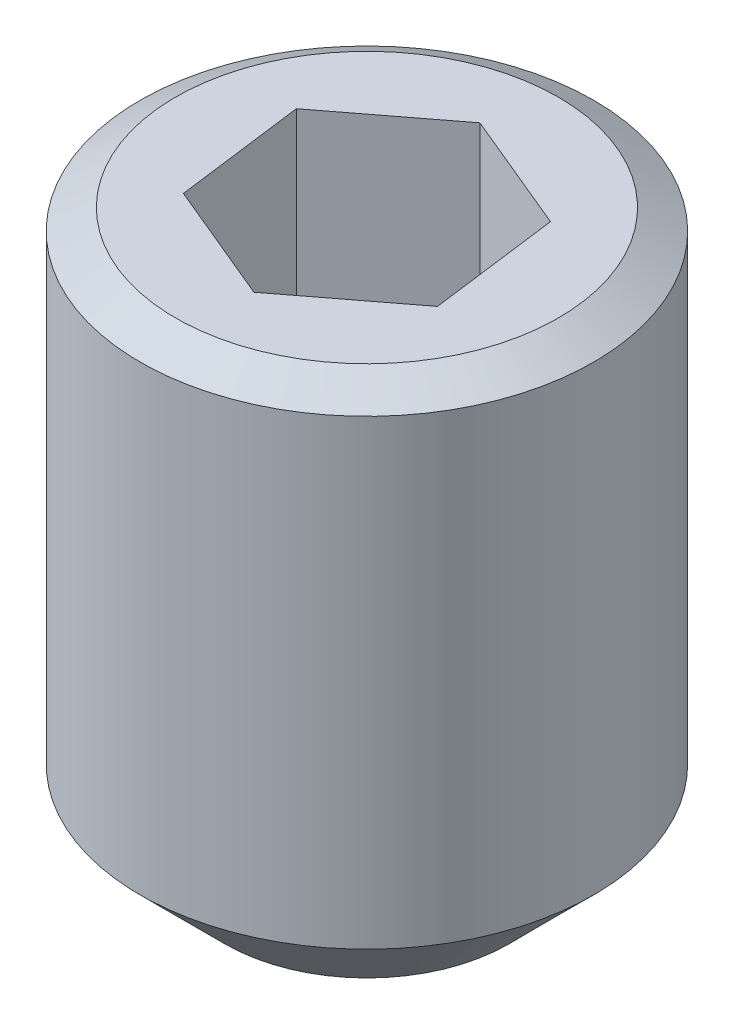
ISO-10303-21;
HEADER;
FILE_DESCRIPTION(('STEP AP214'),'2;1');
FILE_NAME('part.step','',(''),(''),'','','');
FILE_SCHEMA(('AUTOMOTIVE_DESIGN { 1 0 10303 214 1 1 1 1 }'));
ENDSEC;
DATA;
#1=APPLICATION_CONTEXT('core data for automotive mechanical design processes');
#2=APPLICATION_PROTOCOL_DEFINITION('international standard','automotive_design',2000,#1);
#3=PRODUCT_CONTEXT('',#1,'mechanical');
#4=PRODUCT('Part','Part','',(#3));
#5=PRODUCT_RELATED_PRODUCT_CATEGORY('part','',(#4));
#6=PRODUCT_DEFINITION_FORMATION('','',#4);
#7=PRODUCT_DEFINITION_CONTEXT('part definition',#1,'design');
#8=PRODUCT_DEFINITION('design','',#6,#7);
#9=PRODUCT_DEFINITION_SHAPE('','',#8);
#10=(LENGTH_UNIT() NAMED_UNIT(*) SI_UNIT(.MILLI.,.METRE.));
#11=(NAMED_UNIT(*) PLANE_ANGLE_UNIT() SI_UNIT($,.RADIAN.));
#12=(NAMED_UNIT(*) SI_UNIT($,.STERADIAN.) SOLID_ANGLE_UNIT());
#13=UNCERTAINTY_MEASURE_WITH_UNIT(LENGTH_MEASURE(1.E-05),#10,'distance_accuracy_value','');
#14=(GEOMETRIC_REPRESENTATION_CONTEXT(3) GLOBAL_UNCERTAINTY_ASSIGNED_CONTEXT((#13)) GLOBAL_UNIT_ASSIGNED_CONTEXT((#10,
#11,#12)) REPRESENTATION_CONTEXT('',''));
#15=CARTESIAN_POINT('',(0.,0.,0.));
#16=DIRECTION('',(0.,0.,1.));
#17=DIRECTION('',(1.,0.,0.));
#18=AXIS2_PLACEMENT_3D('',#15,#16,#17);
#19=CARTESIAN_POINT('',(3.375,10.,0.));
#20=DIRECTION('',(0.,1.,0.));
#21=DIRECTION('',(0.,0.,1.));
#22=AXIS2_PLACEMENT_3D('',#19,#20,#21);
#23=PLANE('',#22);
#24=DIRECTION('',(0.128888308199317,0.,0.991659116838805));
#25=VECTOR('',#24,1.);
#26=CARTESIAN_POINT('',(-2.13214563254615,10.,-0.887292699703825));
#27=LINE('',#26,#25);
#28=CARTESIAN_POINT('',(-2.13214563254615,10.,-0.887292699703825));
#29=VERTEX_POINT('',#28);
#30=CARTESIAN_POINT('',(-1.83449083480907,10.,1.4028459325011));
#31=VERTEX_POINT('',#30);
#32=EDGE_CURVE('E47',#29,#31,#27,.T.);
#33=ORIENTED_EDGE('',*,*,#32,.F.);
#34=DIRECTION('',(-0.794357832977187,0.,0.607450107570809));
#35=VECTOR('',#34,1.);
#36=CARTESIAN_POINT('',(-0.297654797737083,10.,-2.29013863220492));
#37=LINE('',#36,#35);
#38=CARTESIAN_POINT('',(-0.297654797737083,10.,-2.29013863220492));
#39=VERTEX_POINT('',#38);
#40=EDGE_CURVE('E130',#39,#29,#37,.T.);
#41=ORIENTED_EDGE('',*,*,#40,.F.);
#42=DIRECTION('',(-0.923246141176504,0.,-0.384209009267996));
#43=VECTOR('',#42,1.);
#44=CARTESIAN_POINT('',(1.83449083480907,10.,-1.40284593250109));
#45=LINE('',#44,#43);
#46=CARTESIAN_POINT('',(1.83449083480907,10.,-1.40284593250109));
#47=VERTEX_POINT('',#46);
#48=EDGE_CURVE('E128',#47,#39,#45,.T.);
#49=ORIENTED_EDGE('',*,*,#48,.F.);
#50=DIRECTION('',(-0.128888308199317,0.,-0.991659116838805));
#51=VECTOR('',#50,1.);
#52=CARTESIAN_POINT('',(2.13214563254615,10.,0.88729269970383));
#53=LINE('',#52,#51);
#54=CARTESIAN_POINT('',(2.13214563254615,10.,0.88729269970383));
#55=VERTEX_POINT('',#54);
#56=EDGE_CURVE('E95',#55,#47,#53,.T.);
#57=ORIENTED_EDGE('',*,*,#56,.F.);
#58=DIRECTION('',(0.794357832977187,0.,-0.607450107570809));
#59=VECTOR('',#58,1.);
#60=CARTESIAN_POINT('',(0.297654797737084,10.,2.29013863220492));
#61=LINE('',#60,#59);
#62=CARTESIAN_POINT('',(0.297654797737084,10.,2.29013863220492));
#63=VERTEX_POINT('',#62);
#64=EDGE_CURVE('E124',#63,#55,#61,.T.);
#65=ORIENTED_EDGE('',*,*,#64,.F.);
#66=DIRECTION('',(0.923246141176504,0.,0.384209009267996));
#67=VECTOR('',#66,1.);
#68=CARTESIAN_POINT('',(-1.83449083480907,10.,1.4028459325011));
#69=LINE('',#68,#67);
#70=EDGE_CURVE('E121',#31,#63,#69,.T.);
#71=ORIENTED_EDGE('',*,*,#70,.F.);
#72=EDGE_LOOP('',(#33,#41,#49,#57,#65,#71));
#73=FACE_BOUND('',#72,.T.);
#74=CARTESIAN_POINT('',(0.,10.,0.));
#75=DIRECTION('',(0.,-1.,0.));
#76=DIRECTION('',(0.,0.,-1.));
#77=AXIS2_PLACEMENT_3D('',#74,#75,#76);
#78=CIRCLE('',#77,3.375);
#79=CARTESIAN_POINT('',(0.,10.,-3.375));
#80=VERTEX_POINT('',#79);
#81=EDGE_CURVE('E11',#80,#80,#78,.T.);
#82=ORIENTED_EDGE('',*,*,#81,.F.);
#83=EDGE_LOOP('',(#82));
#84=FACE_BOUND('',#83,.T.);
#85=ADVANCED_FACE('F33',(#73,#84),#23,.T.);
#86=CARTESIAN_POINT('',(0.,9.63915608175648,0.));
#87=DIRECTION('',(0.,-1.,0.));
#88=DIRECTION('',(0.,0.,-1.));
#89=AXIS2_PLACEMENT_3D('',#86,#87,#88);
#90=CONICAL_SURFACE('',#89,4.,1.0471975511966);
#91=ORIENTED_EDGE('',*,*,#81,.T.);
#92=EDGE_LOOP('',(#91));
#93=FACE_BOUND('',#92,.T.);
#94=CARTESIAN_POINT('',(0.,9.63915608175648,0.));
#95=DIRECTION('',(0.,-1.,0.));
#96=DIRECTION('',(0.,0.,-1.));
#97=AXIS2_PLACEMENT_3D('',#94,#95,#96);
#98=CIRCLE('',#97,4.);
#99=CARTESIAN_POINT('',(0.,9.63915608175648,-4.));
#100=VERTEX_POINT('',#99);
#101=EDGE_CURVE('E40',#100,#100,#98,.T.);
#102=ORIENTED_EDGE('',*,*,#101,.F.);
#103=EDGE_LOOP('',(#102));
#104=FACE_BOUND('',#103,.T.);
#105=ADVANCED_FACE('F150',(#93,#104),#90,.T.);
#106=CARTESIAN_POINT('',(0.,0.,0.));
#107=DIRECTION('',(0.,-1.,0.));
#108=DIRECTION('',(0.,0.,-1.));
#109=AXIS2_PLACEMENT_3D('',#106,#107,#108);
#110=CYLINDRICAL_SURFACE('',#109,4.);
#111=ORIENTED_EDGE('',*,*,#101,.T.);
#112=EDGE_LOOP('',(#111));
#113=FACE_BOUND('',#112,.T.);
#114=CARTESIAN_POINT('',(0.,1.5,0.));
#115=DIRECTION('',(0.,-1.,0.));
#116=DIRECTION('',(0.,0.,-1.));
#117=AXIS2_PLACEMENT_3D('',#114,#115,#116);
#118=CIRCLE('',#117,4.);
#119=CARTESIAN_POINT('',(0.,1.5,-4.));
#120=VERTEX_POINT('',#119);
#121=EDGE_CURVE('E142',#120,#120,#118,.T.);
#122=ORIENTED_EDGE('',*,*,#121,.F.);
#123=EDGE_LOOP('',(#122));
#124=FACE_BOUND('',#123,.T.);
#125=ADVANCED_FACE('F147',(#113,#124),#110,.T.);
#126=CARTESIAN_POINT('',(0.,0.,0.));
#127=DIRECTION('',(0.,1.,0.));
#128=DIRECTION('',(0.,0.,1.));
#129=AXIS2_PLACEMENT_3D('',#126,#127,#128);
#130=CONICAL_SURFACE('',#129,2.50000000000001,0.785398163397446);
#131=ORIENTED_EDGE('',*,*,#121,.T.);
#132=EDGE_LOOP('',(#131));
#133=FACE_BOUND('',#132,.T.);
#134=CARTESIAN_POINT('',(0.,0.,0.));
#135=DIRECTION('',(0.,-1.,0.));
#136=DIRECTION('',(0.,0.,-1.));
#137=AXIS2_PLACEMENT_3D('',#134,#135,#136);
#138=CIRCLE('',#137,2.50000000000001);
#139=CARTESIAN_POINT('',(0.,0.,-2.50000000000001));
#140=VERTEX_POINT('',#139);
#141=EDGE_CURVE('E134',#140,#140,#138,.T.);
#142=ORIENTED_EDGE('',*,*,#141,.F.);
#143=EDGE_LOOP('',(#142));
#144=FACE_BOUND('',#143,.T.);
#145=ADVANCED_FACE('F157',(#133,#144),#130,.T.);
#146=CARTESIAN_POINT('',(0.,0.,0.));
#147=DIRECTION('',(0.,-1.,0.));
#148=DIRECTION('',(0.,0.,-1.));
#149=AXIS2_PLACEMENT_3D('',#146,#147,#148);
#150=PLANE('',#149);
#151=ORIENTED_EDGE('',*,*,#141,.T.);
#152=EDGE_LOOP('',(#151));
#153=FACE_BOUND('',#152,.T.);
#154=ADVANCED_FACE('F163',(#153),#150,.T.);
#155=CARTESIAN_POINT('',(-2.13214563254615,5.,-0.887292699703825));
#156=DIRECTION('',(-0.991659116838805,0.,0.128888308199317));
#157=DIRECTION('',(0.128888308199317,0.,0.991659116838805));
#158=AXIS2_PLACEMENT_3D('',#155,#156,#157);
#159=PLANE('',#158);
#160=ORIENTED_EDGE('',*,*,#32,.T.);
#161=DIRECTION('',(0.,1.,0.));
#162=VECTOR('',#161,1.);
#163=CARTESIAN_POINT('',(-1.83449083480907,5.,1.4028459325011));
#164=LINE('',#163,#162);
#165=CARTESIAN_POINT('',(-1.83449083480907,5.,1.4028459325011));
#166=VERTEX_POINT('',#165);
#167=EDGE_CURVE('E77',#166,#31,#164,.T.);
#168=ORIENTED_EDGE('',*,*,#167,.F.);
#169=DIRECTION('',(0.128888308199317,0.,0.991659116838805));
#170=VECTOR('',#169,1.);
#171=CARTESIAN_POINT('',(-2.13214563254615,5.,-0.887292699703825));
#172=LINE('',#171,#170);
#173=CARTESIAN_POINT('',(-2.13214563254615,5.,-0.887292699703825));
#174=VERTEX_POINT('',#173);
#175=EDGE_CURVE('E132',#174,#166,#172,.T.);
#176=ORIENTED_EDGE('',*,*,#175,.F.);
#177=DIRECTION('',(0.,1.,0.));
#178=VECTOR('',#177,1.);
#179=CARTESIAN_POINT('',(-2.13214563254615,5.,-0.887292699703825));
#180=LINE('',#179,#178);
#181=EDGE_CURVE('E55',#174,#29,#180,.T.);
#182=ORIENTED_EDGE('',*,*,#181,.T.);
#183=EDGE_LOOP('',(#160,#168,#176,#182));
#184=FACE_BOUND('',#183,.T.);
#185=ADVANCED_FACE('F167',(#184),#159,.F.);
#186=CARTESIAN_POINT('',(-0.297654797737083,5.,-2.29013863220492));
#187=DIRECTION('',(-0.607450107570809,0.,-0.794357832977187));
#188=DIRECTION('',(-0.794357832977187,0.,0.607450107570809));
#189=AXIS2_PLACEMENT_3D('',#186,#187,#188);
#190=PLANE('',#189);
#191=ORIENTED_EDGE('',*,*,#40,.T.);
#192=ORIENTED_EDGE('',*,*,#181,.F.);
#193=DIRECTION('',(-0.794357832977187,0.,0.607450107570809));
#194=VECTOR('',#193,1.);
#195=CARTESIAN_POINT('',(-0.297654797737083,5.,-2.29013863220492));
#196=LINE('',#195,#194);
#197=CARTESIAN_POINT('',(-0.297654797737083,5.,-2.29013863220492));
#198=VERTEX_POINT('',#197);
#199=EDGE_CURVE('E107',#198,#174,#196,.T.);
#200=ORIENTED_EDGE('',*,*,#199,.F.);
#201=DIRECTION('',(0.,1.,0.));
#202=VECTOR('',#201,1.);
#203=CARTESIAN_POINT('',(-0.297654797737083,5.,-2.29013863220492));
#204=LINE('',#203,#202);
#205=EDGE_CURVE('E99',#198,#39,#204,.T.);
#206=ORIENTED_EDGE('',*,*,#205,.T.);
#207=EDGE_LOOP('',(#191,#192,#200,#206));
#208=FACE_BOUND('',#207,.T.);
#209=ADVANCED_FACE('F171',(#208),#190,.F.);
#210=CARTESIAN_POINT('',(1.83449083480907,5.,-1.40284593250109));
#211=DIRECTION('',(0.384209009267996,0.,-0.923246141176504));
#212=DIRECTION('',(-0.923246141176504,0.,-0.384209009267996));
#213=AXIS2_PLACEMENT_3D('',#210,#211,#212);
#214=PLANE('',#213);
#215=ORIENTED_EDGE('',*,*,#48,.T.);
#216=ORIENTED_EDGE('',*,*,#205,.F.);
#217=DIRECTION('',(-0.923246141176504,0.,-0.384209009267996));
#218=VECTOR('',#217,1.);
#219=CARTESIAN_POINT('',(1.83449083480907,5.,-1.40284593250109));
#220=LINE('',#219,#218);
#221=CARTESIAN_POINT('',(1.83449083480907,5.,-1.40284593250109));
#222=VERTEX_POINT('',#221);
#223=EDGE_CURVE('E103',#222,#198,#220,.T.);
#224=ORIENTED_EDGE('',*,*,#223,.F.);
#225=DIRECTION('',(0.,1.,0.));
#226=VECTOR('',#225,1.);
#227=CARTESIAN_POINT('',(1.83449083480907,5.,-1.40284593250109));
#228=LINE('',#227,#226);
#229=EDGE_CURVE('E88',#222,#47,#228,.T.);
#230=ORIENTED_EDGE('',*,*,#229,.T.);
#231=EDGE_LOOP('',(#215,#216,#224,#230));
#232=FACE_BOUND('',#231,.T.);
#233=ADVANCED_FACE('F104',(#232),#214,.F.);
#234=CARTESIAN_POINT('',(2.13214563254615,5.,0.88729269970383));
#235=DIRECTION('',(0.991659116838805,0.,-0.128888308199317));
#236=DIRECTION('',(-0.128888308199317,0.,-0.991659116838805));
#237=AXIS2_PLACEMENT_3D('',#234,#235,#236);
#238=PLANE('',#237);
#239=ORIENTED_EDGE('',*,*,#56,.T.);
#240=ORIENTED_EDGE('',*,*,#229,.F.);
#241=DIRECTION('',(-0.128888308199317,0.,-0.991659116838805));
#242=VECTOR('',#241,1.);
#243=CARTESIAN_POINT('',(2.13214563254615,5.,0.88729269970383));
#244=LINE('',#243,#242);
#245=CARTESIAN_POINT('',(2.13214563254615,5.,0.88729269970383));
#246=VERTEX_POINT('',#245);
#247=EDGE_CURVE('E92',#246,#222,#244,.T.);
#248=ORIENTED_EDGE('',*,*,#247,.F.);
#249=DIRECTION('',(0.,1.,0.));
#250=VECTOR('',#249,1.);
#251=CARTESIAN_POINT('',(2.13214563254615,5.,0.88729269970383));
#252=LINE('',#251,#250);
#253=EDGE_CURVE('E100',#246,#55,#252,.T.);
#254=ORIENTED_EDGE('',*,*,#253,.T.);
#255=EDGE_LOOP('',(#239,#240,#248,#254));
#256=FACE_BOUND('',#255,.T.);
#257=ADVANCED_FACE('F90',(#256),#238,.F.);
#258=CARTESIAN_POINT('',(0.297654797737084,5.,2.29013863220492));
#259=DIRECTION('',(0.607450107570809,0.,0.794357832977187));
#260=DIRECTION('',(0.794357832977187,0.,-0.607450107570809));
#261=AXIS2_PLACEMENT_3D('',#258,#259,#260);
#262=PLANE('',#261);
#263=ORIENTED_EDGE('',*,*,#64,.T.);
#264=ORIENTED_EDGE('',*,*,#253,.F.);
#265=DIRECTION('',(0.794357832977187,0.,-0.607450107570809));
#266=VECTOR('',#265,1.);
#267=CARTESIAN_POINT('',(0.297654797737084,5.,2.29013863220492));
#268=LINE('',#267,#266);
#269=CARTESIAN_POINT('',(0.297654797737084,5.,2.29013863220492));
#270=VERTEX_POINT('',#269);
#271=EDGE_CURVE('E113',#270,#246,#268,.T.);
#272=ORIENTED_EDGE('',*,*,#271,.F.);
#273=DIRECTION('',(0.,1.,0.));
#274=VECTOR('',#273,1.);
#275=CARTESIAN_POINT('',(0.297654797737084,5.,2.29013863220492));
#276=LINE('',#275,#274);
#277=EDGE_CURVE('E137',#270,#63,#276,.T.);
#278=ORIENTED_EDGE('',*,*,#277,.T.);
#279=EDGE_LOOP('',(#263,#264,#272,#278));
#280=FACE_BOUND('',#279,.T.);
#281=ADVANCED_FACE('F175',(#280),#262,.F.);
#282=CARTESIAN_POINT('',(-1.83449083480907,5.,1.4028459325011));
#283=DIRECTION('',(-0.384209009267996,0.,0.923246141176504));
#284=DIRECTION('',(0.923246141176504,0.,0.384209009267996));
#285=AXIS2_PLACEMENT_3D('',#282,#283,#284);
#286=PLANE('',#285);
#287=ORIENTED_EDGE('',*,*,#70,.T.);
#288=ORIENTED_EDGE('',*,*,#277,.F.);
#289=DIRECTION('',(0.923246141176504,0.,0.384209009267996));
#290=VECTOR('',#289,1.);
#291=CARTESIAN_POINT('',(-1.83449083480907,5.,1.4028459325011));
#292=LINE('',#291,#290);
#293=EDGE_CURVE('E115',#166,#270,#292,.T.);
#294=ORIENTED_EDGE('',*,*,#293,.F.);
#295=ORIENTED_EDGE('',*,*,#167,.T.);
#296=EDGE_LOOP('',(#287,#288,#294,#295));
#297=FACE_BOUND('',#296,.T.);
#298=ADVANCED_FACE('F172',(#297),#286,.F.);
#299=CARTESIAN_POINT('',(-2.42980043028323,5.,-3.17743133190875));
#300=DIRECTION('',(0.,-1.,0.));
#301=DIRECTION('',(0.,0.,-1.));
#302=AXIS2_PLACEMENT_3D('',#299,#300,#301);
#303=PLANE('',#302);
#304=ORIENTED_EDGE('',*,*,#175,.T.);
#305=ORIENTED_EDGE('',*,*,#293,.T.);
#306=ORIENTED_EDGE('',*,*,#271,.T.);
#307=ORIENTED_EDGE('',*,*,#247,.T.);
#308=ORIENTED_EDGE('',*,*,#223,.T.);
#309=ORIENTED_EDGE('',*,*,#199,.T.);
#310=EDGE_LOOP('',(#304,#305,#306,#307,#308,#309));
#311=FACE_BOUND('',#310,.T.);
#312=ADVANCED_FACE('F110',(#311),#303,.F.);
#313=CLOSED_SHELL('',(#85,#105,#125,#145,#154,#185,#209,#233,#257,#281,#298,#312));
#314=MANIFOLD_SOLID_BREP('B2',#313);
#315=ADVANCED_BREP_SHAPE_REPRESENTATION('',(#18,#314),#14);
#316=SHAPE_DEFINITION_REPRESENTATION(#9,#315);
ENDSEC;
END-ISO-10303-21;
